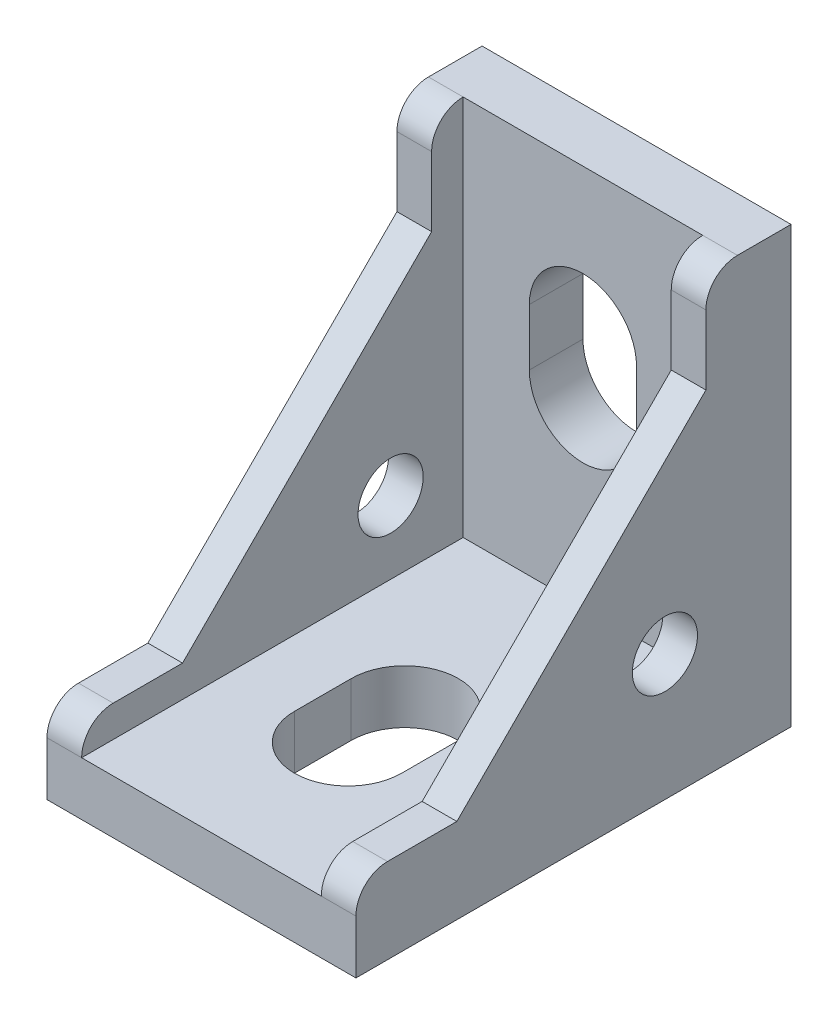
from build123d import *

# Parameters (mm, degrees)
SKETCH1_W           = 27.6
SKETCH1_H           = 27.6
BOSS_EXTRUDE1_DEPTH = 9.8
CUT_EXTRUDE1_DEPTH  = 44.676996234
SKETCH3_W           = 15.2
SKETCH3_H           = 24.2
CUT_EXTRUDE2_DEPTH  = 24.2
CUT_EXTRUDE3_DEPTH  = 44.676996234
FILLET110_R         = 2
CUT_EXTRUDE4_DEPTH  = 38.992630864
CUT_EXTRUDE5_DEPTH  = 38.992630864
SKETCH7_W           = 5.8
SKETCH7_H           = 3
BOSS_EXTRUDE2_DEPTH = 2
SKETCH8_W           = 5.8
SKETCH8_H           = 3
BOSS_EXTRUDE3_DEPTH = 2
CUT_EXTRUDE6_DEPTH  = 42.046437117
TAP101_D            = 4.134


with BuildPart() as part:
    # Sketch1 → Boss-Extrude1 (new, symmetric)
    with BuildSketch(Plane(origin=(0, 0, 0), x_dir=(0, 0, -1), z_dir=(1, 0, 0))):
        with Locations((-13.8, 13.8)):
            Rectangle(SKETCH1_W, SKETCH1_H)
    extrude(amount=BOSS_EXTRUDE1_DEPTH, both=True)

    # Sketch2 → Cut-Extrude1 (cut, through all)
    with BuildSketch(Plane.ZY.offset(9.8)):
        Polygon((27.6, 27.6), (5.4, 27.6), (27.6, 5.4), align=None)
    extrude(amount=-CUT_EXTRUDE1_DEPTH, mode=Mode.SUBTRACT)

    # Sketch3 → Cut-Extrude2 (cut)
    with BuildSketch(Plane(origin=(0, 27.6, 0), x_dir=(1, 0, 0), z_dir=(0, 1, 0))):
        with Locations((0, -15.5)):
            Rectangle(SKETCH3_W, SKETCH3_H)
    extrude(amount=-CUT_EXTRUDE2_DEPTH, mode=Mode.SUBTRACT)

    # Sketch4 → Cut-Extrude3 (cut, through all)
    with BuildSketch(Plane.ZY.offset(9.8)):
        Polygon((5.4, 27.6), (5.4, 21.2), (21.2, 5.4), (27.6, 5.4), align=None)
    extrude(amount=-CUT_EXTRUDE3_DEPTH, mode=Mode.SUBTRACT)

    # Fillet110
    fillet110_edges = [part.edges().sort_by_distance(p)[0] for p in [
        (8.7, 5.4, 27.6),
        (-8.7, 5.4, 27.6),
        (8.7, 27.6, 5.4),
        (-8.7, 27.6, 5.4),
    ]]
    fillet(fillet110_edges, radius=FILLET110_R)

    # Sketch5 → Cut-Extrude4 (cut, through all)
    with BuildSketch(Plane.XY.offset(3.4)):
        with BuildLine():
            Line((-3.4, 14.7), (-3.4, 18.3))
            ThreePointArc((-3.4, 18.3), (0, 21.7), (3.4, 18.3))
            Line((3.4, 18.3), (3.4, 14.7))
            ThreePointArc((3.4, 14.7), (0, 11.3), (-3.4, 14.7))
        make_face()
    extrude(amount=-CUT_EXTRUDE4_DEPTH, mode=Mode.SUBTRACT)

    # Sketch6 → Cut-Extrude5 (cut, through all)
    with BuildSketch(Plane(origin=(0, 3.4, 0), x_dir=(1, 0, 0), z_dir=(0, 1, 0))):
        with BuildLine():
            Line((3.4, -14.7), (3.4, -18.3))
            ThreePointArc((3.4, -18.3), (0, -21.7), (-3.4, -18.3))
            Line((-3.4, -18.3), (-3.4, -14.7))
            ThreePointArc((-3.4, -14.7), (0, -11.3), (3.4, -14.7))
        make_face()
    extrude(amount=-CUT_EXTRUDE5_DEPTH, mode=Mode.SUBTRACT)

    # Sketch7 → Boss-Extrude2 (add)
    with BuildSketch(Plane(origin=(0, 0, 0), x_dir=(-1, 0, 0), z_dir=(0, 0, -1))):
        with Locations((0, 24.6)):
            Rectangle(SKETCH7_W, SKETCH7_H)
        with Locations((0, 3)):
            Rectangle(SKETCH7_W, SKETCH7_H)
    extrude(amount=BOSS_EXTRUDE2_DEPTH)

    # Sketch8 → Boss-Extrude3 (add)
    with BuildSketch(Plane.XZ):
        with Locations((0, 24.6)):
            Rectangle(SKETCH8_W, SKETCH8_H)
        with Locations((0, 3)):
            Rectangle(SKETCH8_W, SKETCH8_H)
    extrude(amount=BOSS_EXTRUDE3_DEPTH)

    # Sketch9 → Cut-Extrude6 (cut, through all)
    with BuildSketch(Plane(origin=(2.9, 0, 0), x_dir=(0, 0, -1), z_dir=(1, 0, 0))):
        Polygon((0, 26.1), (2, 23.6), (2, 26.1), align=None)
        Polygon((0, 4.5), (2, 4.5), (2, 2), align=None)
        Polygon((-26.1, 0), (-26.1, -2), (-23.6, -2), align=None)
        Polygon((-4.5, 0), (-4.5, -2), (-2, -2), align=None)
    extrude(amount=-CUT_EXTRUDE6_DEPTH, mode=Mode.SUBTRACT)

    # Tap101 (through all)
    with Locations(Plane.ZY.offset(9.8)):
        with Locations((8, 8)):
            Hole(TAP101_D / 2)


solid = part.part
